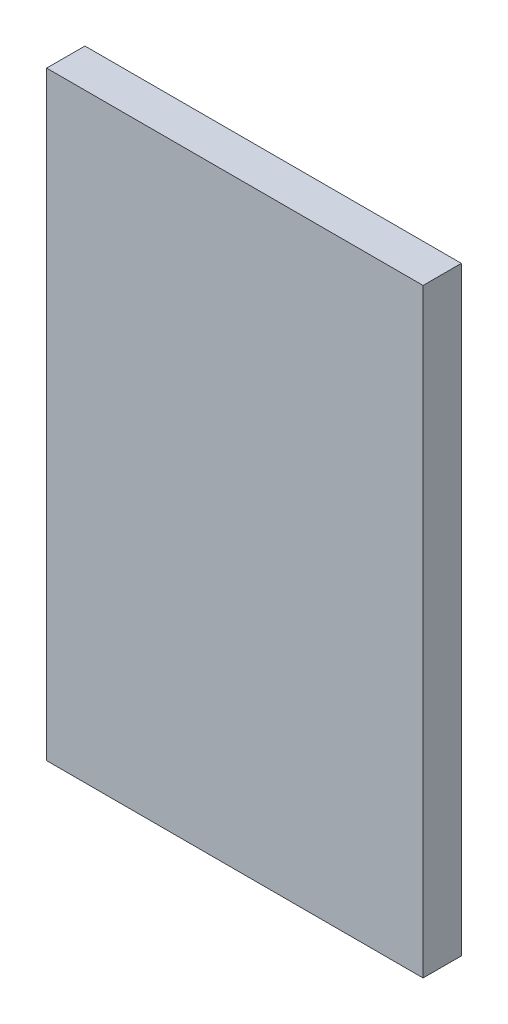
ISO-10303-21;
HEADER;
FILE_DESCRIPTION(('STEP AP214'),'2;1');
FILE_NAME('part.step','',(''),(''),'','','');
FILE_SCHEMA(('AUTOMOTIVE_DESIGN { 1 0 10303 214 1 1 1 1 }'));
ENDSEC;
DATA;
#1=APPLICATION_CONTEXT('core data for automotive mechanical design processes');
#2=APPLICATION_PROTOCOL_DEFINITION('international standard','automotive_design',2000,#1);
#3=PRODUCT_CONTEXT('',#1,'mechanical');
#4=PRODUCT('Part','Part','',(#3));
#5=PRODUCT_RELATED_PRODUCT_CATEGORY('part','',(#4));
#6=PRODUCT_DEFINITION_FORMATION('','',#4);
#7=PRODUCT_DEFINITION_CONTEXT('part definition',#1,'design');
#8=PRODUCT_DEFINITION('design','',#6,#7);
#9=PRODUCT_DEFINITION_SHAPE('','',#8);
#10=(LENGTH_UNIT() NAMED_UNIT(*) SI_UNIT(.MILLI.,.METRE.));
#11=(NAMED_UNIT(*) PLANE_ANGLE_UNIT() SI_UNIT($,.RADIAN.));
#12=(NAMED_UNIT(*) SI_UNIT($,.STERADIAN.) SOLID_ANGLE_UNIT());
#13=UNCERTAINTY_MEASURE_WITH_UNIT(LENGTH_MEASURE(1.E-05),#10,'distance_accuracy_value','');
#14=(GEOMETRIC_REPRESENTATION_CONTEXT(3) GLOBAL_UNCERTAINTY_ASSIGNED_CONTEXT((#13)) GLOBAL_UNIT_ASSIGNED_CONTEXT((#10,
#11,#12)) REPRESENTATION_CONTEXT('',''));
#15=CARTESIAN_POINT('',(0.,0.,0.));
#16=DIRECTION('',(0.,0.,1.));
#17=DIRECTION('',(1.,0.,0.));
#18=AXIS2_PLACEMENT_3D('',#15,#16,#17);
#19=CARTESIAN_POINT('',(14.75,23.5,3.));
#20=DIRECTION('',(-1.,0.,0.));
#21=DIRECTION('',(0.,-1.,0.));
#22=AXIS2_PLACEMENT_3D('',#19,#20,#21);
#23=PLANE('',#22);
#24=DIRECTION('',(0.,1.,0.));
#25=VECTOR('',#24,1.);
#26=CARTESIAN_POINT('',(14.75,23.5,0.));
#27=LINE('',#26,#25);
#28=CARTESIAN_POINT('',(14.75,-23.5,0.));
#29=VERTEX_POINT('',#28);
#30=CARTESIAN_POINT('',(14.75,23.5,0.));
#31=VERTEX_POINT('',#30);
#32=EDGE_CURVE('E96',#29,#31,#27,.T.);
#33=ORIENTED_EDGE('',*,*,#32,.T.);
#34=DIRECTION('',(0.,0.,-1.));
#35=VECTOR('',#34,1.);
#36=CARTESIAN_POINT('',(14.75,23.5,3.));
#37=LINE('',#36,#35);
#38=CARTESIAN_POINT('',(14.75,23.5,3.));
#39=VERTEX_POINT('',#38);
#40=EDGE_CURVE('E11',#39,#31,#37,.T.);
#41=ORIENTED_EDGE('',*,*,#40,.F.);
#42=DIRECTION('',(0.,1.,0.));
#43=VECTOR('',#42,1.);
#44=CARTESIAN_POINT('',(14.75,23.5,3.));
#45=LINE('',#44,#43);
#46=CARTESIAN_POINT('',(14.75,-23.5,3.));
#47=VERTEX_POINT('',#46);
#48=EDGE_CURVE('E84',#47,#39,#45,.T.);
#49=ORIENTED_EDGE('',*,*,#48,.F.);
#50=DIRECTION('',(0.,0.,-1.));
#51=VECTOR('',#50,1.);
#52=CARTESIAN_POINT('',(14.75,-23.5,3.));
#53=LINE('',#52,#51);
#54=EDGE_CURVE('E92',#47,#29,#53,.T.);
#55=ORIENTED_EDGE('',*,*,#54,.T.);
#56=EDGE_LOOP('',(#33,#41,#49,#55));
#57=FACE_BOUND('',#56,.T.);
#58=ADVANCED_FACE('F33',(#57),#23,.F.);
#59=CARTESIAN_POINT('',(-14.75,23.5,3.));
#60=DIRECTION('',(0.,-1.,0.));
#61=DIRECTION('',(0.,0.,-1.));
#62=AXIS2_PLACEMENT_3D('',#59,#60,#61);
#63=PLANE('',#62);
#64=DIRECTION('',(-1.,0.,0.));
#65=VECTOR('',#64,1.);
#66=CARTESIAN_POINT('',(-14.75,23.5,0.));
#67=LINE('',#66,#65);
#68=CARTESIAN_POINT('',(-14.75,23.5,0.));
#69=VERTEX_POINT('',#68);
#70=EDGE_CURVE('E88',#31,#69,#67,.T.);
#71=ORIENTED_EDGE('',*,*,#70,.T.);
#72=DIRECTION('',(0.,0.,-1.));
#73=VECTOR('',#72,1.);
#74=CARTESIAN_POINT('',(-14.75,23.5,3.));
#75=LINE('',#74,#73);
#76=CARTESIAN_POINT('',(-14.75,23.5,3.));
#77=VERTEX_POINT('',#76);
#78=EDGE_CURVE('E41',#77,#69,#75,.T.);
#79=ORIENTED_EDGE('',*,*,#78,.F.);
#80=DIRECTION('',(-1.,0.,0.));
#81=VECTOR('',#80,1.);
#82=CARTESIAN_POINT('',(-14.75,23.5,3.));
#83=LINE('',#82,#81);
#84=EDGE_CURVE('E79',#39,#77,#83,.T.);
#85=ORIENTED_EDGE('',*,*,#84,.F.);
#86=ORIENTED_EDGE('',*,*,#40,.T.);
#87=EDGE_LOOP('',(#71,#79,#85,#86));
#88=FACE_BOUND('',#87,.T.);
#89=ADVANCED_FACE('F87',(#88),#63,.F.);
#90=CARTESIAN_POINT('',(-14.75,23.5,3.));
#91=DIRECTION('',(1.,0.,0.));
#92=DIRECTION('',(0.,1.,0.));
#93=AXIS2_PLACEMENT_3D('',#90,#91,#92);
#94=PLANE('',#93);
#95=DIRECTION('',(0.,-1.,0.));
#96=VECTOR('',#95,1.);
#97=CARTESIAN_POINT('',(-14.75,23.5,0.));
#98=LINE('',#97,#96);
#99=CARTESIAN_POINT('',(-14.75,-23.5,0.));
#100=VERTEX_POINT('',#99);
#101=EDGE_CURVE('E66',#69,#100,#98,.T.);
#102=ORIENTED_EDGE('',*,*,#101,.T.);
#103=DIRECTION('',(0.,0.,-1.));
#104=VECTOR('',#103,1.);
#105=CARTESIAN_POINT('',(-14.75,-23.5,3.));
#106=LINE('',#105,#104);
#107=CARTESIAN_POINT('',(-14.75,-23.5,3.));
#108=VERTEX_POINT('',#107);
#109=EDGE_CURVE('E89',#108,#100,#106,.T.);
#110=ORIENTED_EDGE('',*,*,#109,.F.);
#111=DIRECTION('',(0.,-1.,0.));
#112=VECTOR('',#111,1.);
#113=CARTESIAN_POINT('',(-14.75,23.5,3.));
#114=LINE('',#113,#112);
#115=EDGE_CURVE('E82',#77,#108,#114,.T.);
#116=ORIENTED_EDGE('',*,*,#115,.F.);
#117=ORIENTED_EDGE('',*,*,#78,.T.);
#118=EDGE_LOOP('',(#102,#110,#116,#117));
#119=FACE_BOUND('',#118,.T.);
#120=ADVANCED_FACE('F90',(#119),#94,.F.);
#121=CARTESIAN_POINT('',(-14.75,-23.5,3.));
#122=DIRECTION('',(0.,1.,0.));
#123=DIRECTION('',(0.,0.,1.));
#124=AXIS2_PLACEMENT_3D('',#121,#122,#123);
#125=PLANE('',#124);
#126=DIRECTION('',(1.,0.,0.));
#127=VECTOR('',#126,1.);
#128=CARTESIAN_POINT('',(-14.75,-23.5,0.));
#129=LINE('',#128,#127);
#130=EDGE_CURVE('E72',#100,#29,#129,.T.);
#131=ORIENTED_EDGE('',*,*,#130,.T.);
#132=ORIENTED_EDGE('',*,*,#54,.F.);
#133=DIRECTION('',(1.,0.,0.));
#134=VECTOR('',#133,1.);
#135=CARTESIAN_POINT('',(-14.75,-23.5,3.));
#136=LINE('',#135,#134);
#137=EDGE_CURVE('E49',#108,#47,#136,.T.);
#138=ORIENTED_EDGE('',*,*,#137,.F.);
#139=ORIENTED_EDGE('',*,*,#109,.T.);
#140=EDGE_LOOP('',(#131,#132,#138,#139));
#141=FACE_BOUND('',#140,.T.);
#142=ADVANCED_FACE('F103',(#141),#125,.F.);
#143=CARTESIAN_POINT('',(0.,0.,3.));
#144=DIRECTION('',(0.,0.,1.));
#145=DIRECTION('',(1.,0.,0.));
#146=AXIS2_PLACEMENT_3D('',#143,#144,#145);
#147=PLANE('',#146);
#148=ORIENTED_EDGE('',*,*,#48,.T.);
#149=ORIENTED_EDGE('',*,*,#84,.T.);
#150=ORIENTED_EDGE('',*,*,#115,.T.);
#151=ORIENTED_EDGE('',*,*,#137,.T.);
#152=EDGE_LOOP('',(#148,#149,#150,#151));
#153=FACE_BOUND('',#152,.T.);
#154=ADVANCED_FACE('F80',(#153),#147,.T.);
#155=CARTESIAN_POINT('',(0.,0.,0.));
#156=DIRECTION('',(0.,0.,1.));
#157=DIRECTION('',(1.,0.,0.));
#158=AXIS2_PLACEMENT_3D('',#155,#156,#157);
#159=PLANE('',#158);
#160=ORIENTED_EDGE('',*,*,#32,.F.);
#161=ORIENTED_EDGE('',*,*,#130,.F.);
#162=ORIENTED_EDGE('',*,*,#101,.F.);
#163=ORIENTED_EDGE('',*,*,#70,.F.);
#164=EDGE_LOOP('',(#160,#161,#162,#163));
#165=FACE_BOUND('',#164,.T.);
#166=ADVANCED_FACE('F106',(#165),#159,.F.);
#167=CLOSED_SHELL('',(#58,#89,#120,#142,#154,#166));
#168=MANIFOLD_SOLID_BREP('B2',#167);
#169=ADVANCED_BREP_SHAPE_REPRESENTATION('',(#18,#168),#14);
#170=SHAPE_DEFINITION_REPRESENTATION(#9,#169);
ENDSEC;
END-ISO-10303-21;
